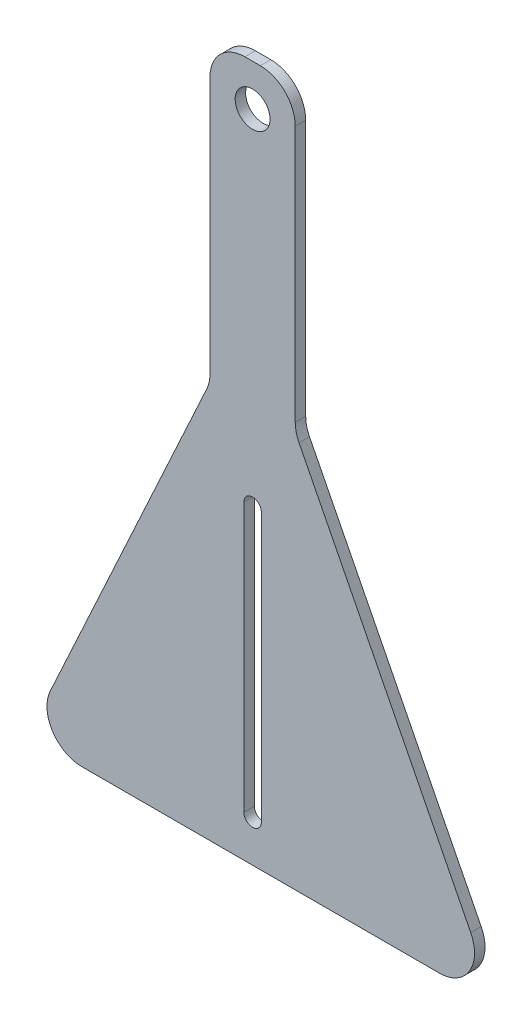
from build123d import *

# Parameters (mm, degrees)
SKETCH1_R          = 5
BASE_EXTRUDE_DEPTH = 3


with BuildPart() as part:
    # Sketch1 → Base-Extrude (new body)
    with BuildSketch(Plane.XY):
        with BuildLine():
            Line((-2.206784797, 11.894084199), (2.206784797, 11.894084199))
            ThreePointArc((2.206784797, 11.894084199), (9.277852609, 8.965152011), (12.206784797, 1.894084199))
            Line((12.206784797, 1.894084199), (12.206784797, -71.541302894))
            ThreePointArc((12.206784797, -71.541302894), (12.481198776, -73.867883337), (13.289380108, -76.06677454))
            Line((13.289380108, -76.06677454), (62.469096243, -172.975001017))
            ThreePointArc((62.469096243, -172.975001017), (62.073860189, -182.732359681), (53.551691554, -187.500472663))
            Line((53.551691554, -187.500472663), (-48.884105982, -187.500472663))
            ThreePointArc((-48.884105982, -187.500472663), (-57.305020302, -182.893820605), (-57.967490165, -173.318113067))
            Line((-57.967490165, -173.318113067), (-13.123400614, -75.924265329))
            ThreePointArc((-13.123400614, -75.924265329), (-12.438626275, -73.882718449), (-12.206784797, -71.741905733))
            Line((-12.206784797, -71.741905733), (-12.206784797, 1.894084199))
            ThreePointArc((-12.206784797, 1.894084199), (-9.277852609, 8.965152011), (-2.206784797, 11.894084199))
        make_face()
        Circle(SKETCH1_R, mode=Mode.SUBTRACT)
        with BuildLine():
            Line((-2.5, -98.671245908), (-2.5, -175.601705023))
            ThreePointArc((-2.5, -175.601705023), (0, -178.101705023), (2.5, -175.601705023))
            Line((2.5, -175.601705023), (2.5, -98.671245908))
            ThreePointArc((2.5, -98.671245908), (0, -96.171245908), (-2.5, -98.671245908))
        make_face(mode=Mode.SUBTRACT)
    extrude(amount=BASE_EXTRUDE_DEPTH)


solid = part.part
